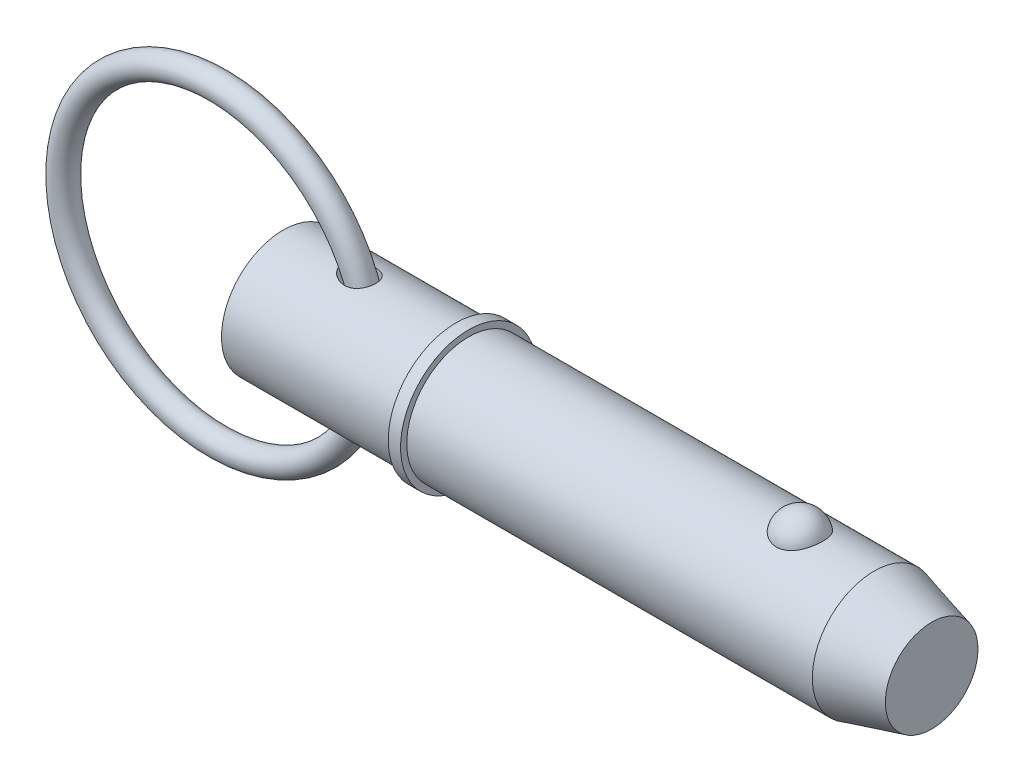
ISO-10303-21;
HEADER;
FILE_DESCRIPTION(('STEP AP214'),'2;1');
FILE_NAME('part.step','',(''),(''),'','','');
FILE_SCHEMA(('AUTOMOTIVE_DESIGN { 1 0 10303 214 1 1 1 1 }'));
ENDSEC;
DATA;
#1=APPLICATION_CONTEXT('core data for automotive mechanical design processes');
#2=APPLICATION_PROTOCOL_DEFINITION('international standard','automotive_design',2000,#1);
#3=PRODUCT_CONTEXT('',#1,'mechanical');
#4=PRODUCT('Part','Part','',(#3));
#5=PRODUCT_RELATED_PRODUCT_CATEGORY('part','',(#4));
#6=PRODUCT_DEFINITION_FORMATION('','',#4);
#7=PRODUCT_DEFINITION_CONTEXT('part definition',#1,'design');
#8=PRODUCT_DEFINITION('design','',#6,#7);
#9=PRODUCT_DEFINITION_SHAPE('','',#8);
#10=(LENGTH_UNIT() NAMED_UNIT(*) SI_UNIT(.MILLI.,.METRE.));
#11=(NAMED_UNIT(*) PLANE_ANGLE_UNIT() SI_UNIT($,.RADIAN.));
#12=(NAMED_UNIT(*) SI_UNIT($,.STERADIAN.) SOLID_ANGLE_UNIT());
#13=UNCERTAINTY_MEASURE_WITH_UNIT(LENGTH_MEASURE(1.E-05),#10,'distance_accuracy_value','');
#14=(GEOMETRIC_REPRESENTATION_CONTEXT(3) GLOBAL_UNCERTAINTY_ASSIGNED_CONTEXT((#13)) GLOBAL_UNIT_ASSIGNED_CONTEXT((#10,
#11,#12)) REPRESENTATION_CONTEXT('',''));
#15=CARTESIAN_POINT('',(0.,0.,0.));
#16=DIRECTION('',(0.,0.,1.));
#17=DIRECTION('',(1.,0.,0.));
#18=AXIS2_PLACEMENT_3D('',#15,#16,#17);
#19=CARTESIAN_POINT('',(-13.4840686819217,0.,0.));
#20=DIRECTION('',(0.,0.,1.));
#21=DIRECTION('',(1.,0.,0.));
#22=AXIS2_PLACEMENT_3D('',#19,#20,#21);
#23=TOROIDAL_SURFACE('',#22,31.75,2.54);
#24=CARTESIAN_POINT('',(20.8059313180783,0.,0.));
#25=VERTEX_POINT('',#24);
#26=VERTEX_LOOP('',#25);
#27=FACE_BOUND('',#26,.T.);
#28=ADVANCED_FACE('P0_F12',(#27),#23,.T.);
#29=CLOSED_SHELL('',(#28));
#30=MANIFOLD_SOLID_BREP('P0_B1',#29);
#31=CARTESIAN_POINT('',(0.,0.,0.));
#32=DIRECTION('',(1.,0.,0.));
#33=DIRECTION('',(0.,0.,-1.));
#34=AXIS2_PLACEMENT_3D('',#31,#32,#33);
#35=CYLINDRICAL_SURFACE('',#34,12.7);
#36=CARTESIAN_POINT('',(13.092900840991,12.5230976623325,-2.11234992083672));
#37=CARTESIAN_POINT('',(13.2535855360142,12.4976398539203,-2.26328363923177));
#38=CARTESIAN_POINT('',(13.4280602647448,12.4718592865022,-2.39955782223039));
#39=CARTESIAN_POINT('',(13.7976341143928,12.4229301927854,-2.64122157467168));
#40=CARTESIAN_POINT('',(13.9927568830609,12.3997847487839,-2.7465751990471));
#41=CARTESIAN_POINT('',(14.397672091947,12.3590534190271,-2.92439761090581));
#42=CARTESIAN_POINT('',(14.6074445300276,12.3414601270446,-2.99691026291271));
#43=CARTESIAN_POINT('',(15.0366557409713,12.3142893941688,-3.10669649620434));
#44=CARTESIAN_POINT('',(15.2560902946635,12.3047084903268,-3.14398530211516));
#45=CARTESIAN_POINT('',(15.5877843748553,12.2976819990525,-3.17128282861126));
#46=CARTESIAN_POINT('',(15.6989364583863,12.2965677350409,-3.17559470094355));
#47=CARTESIAN_POINT('',(15.9211629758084,12.2969101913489,-3.17427486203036));
#48=CARTESIAN_POINT('',(16.0322374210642,12.2983656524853,-3.16864802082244));
#49=CARTESIAN_POINT('',(16.2532861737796,12.3038832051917,-3.14715368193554));
#50=CARTESIAN_POINT('',(16.363260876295,12.3079443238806,-3.13129000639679));
#51=CARTESIAN_POINT('',(16.5810669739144,12.3185954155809,-3.08912320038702));
#52=CARTESIAN_POINT('',(16.6888986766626,12.3251850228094,-3.06282157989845));
#53=CARTESIAN_POINT('',(16.8894247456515,12.3398294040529,-3.00323791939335));
#54=CARTESIAN_POINT('',(16.9824664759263,12.3476389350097,-2.97106098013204));
#55=CARTESIAN_POINT('',(17.1651267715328,12.3648759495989,-2.89848824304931));
#56=CARTESIAN_POINT('',(17.2547457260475,12.3743032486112,-2.85809338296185));
#57=CARTESIAN_POINT('',(17.4297224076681,12.3944822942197,-2.76927391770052));
#58=CARTESIAN_POINT('',(17.5150817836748,12.40523352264,-2.72085245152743));
#59=CARTESIAN_POINT('',(17.6807665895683,12.4277046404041,-2.61629867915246));
#60=CARTESIAN_POINT('',(17.7610923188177,12.4394244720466,-2.56016683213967));
#61=CARTESIAN_POINT('',(17.9797287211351,12.4733252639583,-2.39133767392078));
#62=CARTESIAN_POINT('',(18.1114611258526,12.4961902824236,-2.27005507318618));
#63=CARTESIAN_POINT('',(18.3518677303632,12.5412050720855,-2.00648954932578));
#64=CARTESIAN_POINT('',(18.4605454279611,12.5633549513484,-1.86420981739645));
#65=CARTESIAN_POINT('',(18.6498843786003,12.6039384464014,-1.5661481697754));
#66=CARTESIAN_POINT('',(18.7311185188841,12.622444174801,-1.41073996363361));
#67=CARTESIAN_POINT('',(18.8669149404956,12.6543302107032,-1.08819514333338));
#68=CARTESIAN_POINT('',(18.921477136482,12.6677105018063,-0.921058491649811));
#69=CARTESIAN_POINT('',(19.0028875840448,12.6879542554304,-0.57902988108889));
#70=CARTESIAN_POINT('',(19.0296164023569,12.6947896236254,-0.40410783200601));
#71=CARTESIAN_POINT('',(19.0543673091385,12.7011128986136,-0.0521104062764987));
#72=CARTESIAN_POINT('',(19.0523885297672,12.7006005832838,0.124965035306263));
#73=CARTESIAN_POINT('',(19.019700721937,12.692266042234,0.476969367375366));
#74=CARTESIAN_POINT('',(18.9888798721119,12.6844153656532,0.651887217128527));
#75=CARTESIAN_POINT('',(18.8990221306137,12.6622099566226,0.99389064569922));
#76=CARTESIAN_POINT('',(18.839985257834,12.6478552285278,1.16097622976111));
#77=CARTESIAN_POINT('',(18.6951419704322,12.6142309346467,1.48231767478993));
#78=CARTESIAN_POINT('',(18.6093706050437,12.5949678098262,1.63659000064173));
#79=CARTESIAN_POINT('',(18.4131352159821,12.5536490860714,1.92810749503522));
#80=CARTESIAN_POINT('',(18.3026732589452,12.5315937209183,2.06535408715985));
#81=CARTESIAN_POINT('',(18.060669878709,12.4872833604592,2.31822774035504));
#82=CARTESIAN_POINT('',(17.9292520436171,12.4650302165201,2.43397343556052));
#83=CARTESIAN_POINT('',(17.6485957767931,12.4226514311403,2.64178289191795));
#84=CARTESIAN_POINT('',(17.4993587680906,12.4025256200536,2.73384854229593));
#85=CARTESIAN_POINT('',(17.1869531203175,12.3664726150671,2.8925825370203));
#86=CARTESIAN_POINT('',(17.0237450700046,12.3505578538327,2.95917592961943));
#87=CARTESIAN_POINT('',(16.6884731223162,12.3245177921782,3.06582547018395));
#88=CARTESIAN_POINT('',(16.516407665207,12.3143935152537,3.10587692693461));
#89=CARTESIAN_POINT('',(16.1604213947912,12.3003788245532,3.16093927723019));
#90=CARTESIAN_POINT('',(15.9763106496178,12.2967791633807,3.17478342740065));
#91=CARTESIAN_POINT('',(15.6080973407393,12.2966663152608,3.1752118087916));
#92=CARTESIAN_POINT('',(15.4239948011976,12.3001555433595,3.16178674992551));
#93=CARTESIAN_POINT('',(15.0417156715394,12.3141744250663,3.10676725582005));
#94=CARTESIAN_POINT('',(14.8439465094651,12.3253658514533,3.06251977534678));
#95=CARTESIAN_POINT('',(14.4574652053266,12.3538942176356,2.94531863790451));
#96=CARTESIAN_POINT('',(14.2687614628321,12.3712367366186,2.87233891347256));
#97=CARTESIAN_POINT('',(13.8856104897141,12.4121323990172,2.69045747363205));
#98=CARTESIAN_POINT('',(13.6926012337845,12.4361434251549,2.57861276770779));
#99=CARTESIAN_POINT('',(13.328588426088,12.4862632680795,2.32379935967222));
#100=CARTESIAN_POINT('',(13.1575718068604,12.5123708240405,2.18084927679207));
#101=CARTESIAN_POINT('',(12.8776146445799,12.5579467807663,1.89840233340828));
#102=CARTESIAN_POINT('',(12.7631663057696,12.5776642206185,1.76440341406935));
#103=CARTESIAN_POINT('',(12.5574911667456,12.6143643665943,1.47931295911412));
#104=CARTESIAN_POINT('',(12.4662309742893,12.6313509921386,1.32824646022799));
#105=CARTESIAN_POINT('',(12.3240650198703,12.6583901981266,1.03598403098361));
#106=CARTESIAN_POINT('',(12.2691183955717,12.6691064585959,0.89682285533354));
#107=CARTESIAN_POINT('',(12.1828741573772,12.6860954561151,0.611068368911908));
#108=CARTESIAN_POINT('',(12.1515620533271,12.6923709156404,0.464479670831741));
#109=CARTESIAN_POINT('',(12.1147168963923,12.6997676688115,0.167420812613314));
#110=CARTESIAN_POINT('',(12.109270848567,12.7008715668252,0.0169392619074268));
#111=CARTESIAN_POINT('',(12.1248234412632,12.6977391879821,-0.282592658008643));
#112=CARTESIAN_POINT('',(12.1458245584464,12.6935024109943,-0.431642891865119));
#113=CARTESIAN_POINT('',(12.210908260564,12.6805581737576,-0.716008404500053));
#114=CARTESIAN_POINT('',(12.2537133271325,12.6720986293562,-0.851633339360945));
#115=CARTESIAN_POINT('',(12.3591295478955,12.6516826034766,-1.11460776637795));
#116=CARTESIAN_POINT('',(12.4217455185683,12.6397252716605,-1.24195523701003));
#117=CARTESIAN_POINT('',(12.5735635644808,12.61152213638,-1.50300095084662));
#118=CARTESIAN_POINT('',(12.6652159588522,12.5949150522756,-1.63522875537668));
#119=CARTESIAN_POINT('',(12.8664347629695,12.5599626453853,-1.88501670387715));
#120=CARTESIAN_POINT('',(12.9760196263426,12.541615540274,-2.00256151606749));
#121=CARTESIAN_POINT('',(13.092900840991,12.5230976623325,-2.11234992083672));
#122=B_SPLINE_CURVE_WITH_KNOTS('',3,(#36,#37,#38,#39,#40,#41,#42,#43,#44,#45,#46,#47,#48,#49,
#50,#51,#52,#53,#54,#55,#56,#57,#58,#59,#60,#61,#62,#63,#64,#65,#66,#67,#68,#69,#70,#71,#72,#73,
#74,#75,#76,#77,#78,#79,#80,#81,#82,#83,#84,#85,#86,#87,#88,#89,#90,#91,#92,#93,#94,#95,#96,#97,
#98,#99,#100,#101,#102,#103,#104,#105,#106,#107,#108,#109,#110,#111,#112,#113,#114,#115,#116,
#117,#118,#119,#120,#121),.UNSPECIFIED.,.T.,.F.,(4,2,2,2,2,2,2,2,2,2,2,2,2,2,2,2,2,2,2,2,2,2,2,
2,2,2,2,2,2,2,2,2,2,2,2,2,2,2,2,2,2,2,4),(0.,0.665132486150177,1.33103515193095,
1.99604575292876,2.66076878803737,2.99410229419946,3.32727250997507,3.66031840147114,
3.99331613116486,4.28918991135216,4.58502994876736,4.88075456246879,5.17646157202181,
5.71510826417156,6.25367317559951,6.78017774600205,7.30668400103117,7.83544030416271,
8.36421259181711,8.89504347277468,9.42587399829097,9.95601150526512,10.4861046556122,
11.0131799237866,11.54021312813,12.0687854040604,12.597451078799,13.1491450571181,
13.7010270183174,14.3074556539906,14.914435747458,15.5844380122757,16.2540403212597,
16.7839879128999,17.3131679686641,17.7612578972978,18.2090728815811,18.658393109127,
19.1077554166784,19.5333866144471,19.959121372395,20.4424347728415,20.9262486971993),.UNSPECIFIED.);
#123=CARTESIAN_POINT('',(13.092900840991,12.5230976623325,-2.11234992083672));
#124=VERTEX_POINT('',#123);
#125=EDGE_CURVE('P1_E42',#124,#124,#122,.T.);
#126=ORIENTED_EDGE('',*,*,#125,.T.);
#127=EDGE_LOOP('',(#126));
#128=FACE_BOUND('',#127,.T.);
#129=CARTESIAN_POINT('',(0.,0.,0.));
#130=DIRECTION('',(1.,0.,0.));
#131=DIRECTION('',(0.,0.,-1.));
#132=AXIS2_PLACEMENT_3D('',#129,#130,#131);
#133=CIRCLE('',#132,12.7);
#134=CARTESIAN_POINT('',(0.,0.,-12.7));
#135=VERTEX_POINT('',#134);
#136=EDGE_CURVE('P1_E9',#135,#135,#133,.T.);
#137=ORIENTED_EDGE('',*,*,#136,.T.);
#138=EDGE_LOOP('',(#137));
#139=FACE_BOUND('',#138,.T.);
#140=CARTESIAN_POINT('',(35.56,0.,0.));
#141=DIRECTION('',(1.,0.,0.));
#142=DIRECTION('',(0.,0.,-1.));
#143=AXIS2_PLACEMENT_3D('',#140,#141,#142);
#144=CIRCLE('',#143,12.7);
#145=CARTESIAN_POINT('',(35.56,0.,-12.7));
#146=VERTEX_POINT('',#145);
#147=EDGE_CURVE('P1_E25',#146,#146,#144,.T.);
#148=ORIENTED_EDGE('',*,*,#147,.F.);
#149=EDGE_LOOP('',(#148));
#150=FACE_BOUND('',#149,.T.);
#151=CARTESIAN_POINT('',(13.092900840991,-12.5230976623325,-2.11234992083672));
#152=CARTESIAN_POINT('',(12.9659872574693,-12.5432050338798,-1.99314161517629));
#153=CARTESIAN_POINT('',(12.847667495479,-12.5631124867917,-1.86478966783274));
#154=CARTESIAN_POINT('',(12.6324721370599,-12.6007427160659,-1.59069749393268));
#155=CARTESIAN_POINT('',(12.5355833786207,-12.6184668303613,-1.444968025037));
#156=CARTESIAN_POINT('',(12.4099071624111,-12.642034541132,-1.21450950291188));
#157=CARTESIAN_POINT('',(12.3711427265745,-12.6494175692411,-1.13527163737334));
#158=CARTESIAN_POINT('',(12.3010994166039,-12.6628962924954,-0.973464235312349));
#159=CARTESIAN_POINT('',(12.2698164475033,-12.6689926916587,-0.890896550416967));
#160=CARTESIAN_POINT('',(12.2153933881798,-12.6796767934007,-0.72309085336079));
#161=CARTESIAN_POINT('',(12.192246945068,-12.6842656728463,-0.637854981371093));
#162=CARTESIAN_POINT('',(12.154603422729,-12.6917620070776,-0.465421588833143));
#163=CARTESIAN_POINT('',(12.1401047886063,-12.69466976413,-0.378224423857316));
#164=CARTESIAN_POINT('',(12.1214471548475,-12.6984180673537,-0.214417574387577));
#165=CARTESIAN_POINT('',(12.1161713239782,-12.699481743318,-0.13793855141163));
#166=CARTESIAN_POINT('',(12.1124989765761,-12.7002217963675,0.0152189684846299));
#167=CARTESIAN_POINT('',(12.1141046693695,-12.6998977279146,0.0918975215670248));
#168=CARTESIAN_POINT('',(12.1241695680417,-12.6978712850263,0.244746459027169));
#169=CARTESIAN_POINT('',(12.132625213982,-12.6961696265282,0.320917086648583));
#170=CARTESIAN_POINT('',(12.1562110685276,-12.6914452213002,0.472185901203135));
#171=CARTESIAN_POINT('',(12.1713438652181,-12.6884219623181,0.547283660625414));
#172=CARTESIAN_POINT('',(12.223731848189,-12.6780227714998,0.759415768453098));
#173=CARTESIAN_POINT('',(12.268839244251,-12.6691353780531,0.894507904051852));
#174=CARTESIAN_POINT('',(12.3786059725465,-12.6479567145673,1.1560647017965));
#175=CARTESIAN_POINT('',(12.4432700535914,-12.6356646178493,1.28252725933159));
#176=CARTESIAN_POINT('',(12.5971341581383,-12.607236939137,1.5381272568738));
#177=CARTESIAN_POINT('',(12.6882234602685,-12.5908303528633,1.66609325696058));
#178=CARTESIAN_POINT('',(12.887209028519,-12.5564642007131,1.90792082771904));
#179=CARTESIAN_POINT('',(12.995115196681,-12.5385037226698,2.02177401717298));
#180=CARTESIAN_POINT('',(13.2471335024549,-12.4987806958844,2.25547266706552));
#181=CARTESIAN_POINT('',(13.3941979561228,-12.4769622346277,2.3721269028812));
#182=CARTESIAN_POINT('',(13.7036983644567,-12.4349587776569,2.58329351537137));
#183=CARTESIAN_POINT('',(13.8661464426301,-12.4147750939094,2.67778822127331));
#184=CARTESIAN_POINT('',(14.2306024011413,-12.3748157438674,2.85722657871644));
#185=CARTESIAN_POINT('',(14.4347220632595,-12.3556533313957,2.93804226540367));
#186=CARTESIAN_POINT('',(14.8540416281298,-12.3245430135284,3.06594877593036));
#187=CARTESIAN_POINT('',(15.0692453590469,-12.3125976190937,3.11302786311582));
#188=CARTESIAN_POINT('',(15.3981213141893,-12.3014943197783,3.15648626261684));
#189=CARTESIAN_POINT('',(15.5100235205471,-12.298940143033,3.16639841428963));
#190=CARTESIAN_POINT('',(15.7342812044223,-12.2963942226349,3.17627668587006));
#191=CARTESIAN_POINT('',(15.8466364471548,-12.2964012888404,3.17624742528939));
#192=CARTESIAN_POINT('',(16.0707903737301,-12.2990694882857,3.16589868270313));
#193=CARTESIAN_POINT('',(16.1825892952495,-12.3017293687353,3.1555840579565));
#194=CARTESIAN_POINT('',(16.4046123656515,-12.3096862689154,3.12440163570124));
#195=CARTESIAN_POINT('',(16.514836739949,-12.314982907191,3.10353536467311));
#196=CARTESIAN_POINT('',(16.7211934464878,-12.3273933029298,3.05384263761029));
#197=CARTESIAN_POINT('',(16.8175961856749,-12.3342598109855,3.0260738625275));
#198=CARTESIAN_POINT('',(17.0073515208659,-12.3498131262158,2.96195947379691));
#199=CARTESIAN_POINT('',(17.100704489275,-12.3584997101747,2.92561491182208));
#200=CARTESIAN_POINT('',(17.2834584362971,-12.3774243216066,2.84448580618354));
#201=CARTESIAN_POINT('',(17.3728610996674,-12.3876616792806,2.79970490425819));
#202=CARTESIAN_POINT('',(17.5469061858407,-12.409352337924,2.701939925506));
#203=CARTESIAN_POINT('',(17.6315489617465,-12.4208055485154,2.64895645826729));
#204=CARTESIAN_POINT('',(17.7872886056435,-12.4433734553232,2.54070972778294));
#205=CARTESIAN_POINT('',(17.8589017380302,-12.4544123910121,2.4861716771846));
#206=CARTESIAN_POINT('',(17.9970802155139,-12.4768404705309,2.37105291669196));
#207=CARTESIAN_POINT('',(18.063643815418,-12.4882297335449,2.31047013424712));
#208=CARTESIAN_POINT('',(18.1911677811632,-12.5110137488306,2.18372894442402));
#209=CARTESIAN_POINT('',(18.2521311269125,-12.5224084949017,2.11757353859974));
#210=CARTESIAN_POINT('',(18.3680676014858,-12.5448751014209,1.98014449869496));
#211=CARTESIAN_POINT('',(18.4230385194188,-12.5559468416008,1.90886899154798));
#212=CARTESIAN_POINT('',(18.5752306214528,-12.5875288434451,1.6925769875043));
#213=CARTESIAN_POINT('',(18.6637018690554,-12.6071482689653,1.54111740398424));
#214=CARTESIAN_POINT('',(18.8143485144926,-12.6417556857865,1.225260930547));
#215=CARTESIAN_POINT('',(18.876524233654,-12.6567437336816,1.06086419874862));
#216=CARTESIAN_POINT('',(18.9733884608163,-12.6805238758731,0.723195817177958));
#217=CARTESIAN_POINT('',(19.0079967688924,-12.6892978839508,0.549899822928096));
#218=CARTESIAN_POINT('',(19.0486500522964,-12.6996362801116,0.199781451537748));
#219=CARTESIAN_POINT('',(19.054694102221,-12.7012004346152,0.0229589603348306));
#220=CARTESIAN_POINT('',(19.0380549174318,-12.6969431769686,-0.330044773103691));
#221=CARTESIAN_POINT('',(19.0152419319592,-12.6910884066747,-0.506219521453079));
#222=CARTESIAN_POINT('',(18.9411599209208,-12.672565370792,-0.852112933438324));
#223=CARTESIAN_POINT('',(18.8898907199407,-12.659897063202,-1.0218315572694));
#224=CARTESIAN_POINT('',(18.7600888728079,-12.6291327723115,-1.34987035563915));
#225=CARTESIAN_POINT('',(18.6815715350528,-12.6110398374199,-1.50819687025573));
#226=CARTESIAN_POINT('',(18.4991526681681,-12.5714188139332,-1.808997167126));
#227=CARTESIAN_POINT('',(18.3952529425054,-12.5498909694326,-1.95147207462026));
#228=CARTESIAN_POINT('',(18.1653806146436,-12.5059234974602,-2.21580059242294));
#229=CARTESIAN_POINT('',(18.0395297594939,-12.4834893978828,-2.33776101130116));
#230=CARTESIAN_POINT('',(17.7688701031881,-12.4400863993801,-2.55870399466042));
#231=CARTESIAN_POINT('',(17.624063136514,-12.4191173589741,-2.65768878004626));
#232=CARTESIAN_POINT('',(17.3196803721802,-12.380896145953,-2.8304192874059));
#233=CARTESIAN_POINT('',(17.1601036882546,-12.3636441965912,-2.90416349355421));
#234=CARTESIAN_POINT('',(16.8308162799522,-12.3345597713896,-3.02531546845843));
#235=CARTESIAN_POINT('',(16.6611041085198,-12.322728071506,-3.07271946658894));
#236=CARTESIAN_POINT('',(16.3099674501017,-12.3051318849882,-3.14246490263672));
#237=CARTESIAN_POINT('',(16.1283412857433,-12.2996014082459,-3.16384159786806));
#238=CARTESIAN_POINT('',(15.7639014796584,-12.2955807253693,-3.17942379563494));
#239=CARTESIAN_POINT('',(15.5810875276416,-12.2970924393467,-3.17362188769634));
#240=CARTESIAN_POINT('',(15.20154276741,-12.307074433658,-3.13470416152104));
#241=CARTESIAN_POINT('',(15.0050835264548,-12.316173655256,-3.09911848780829));
#242=CARTESIAN_POINT('',(14.6197996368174,-12.3407987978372,-2.99954607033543));
#243=CARTESIAN_POINT('',(14.4309834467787,-12.3563316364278,-2.93552875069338));
#244=CARTESIAN_POINT('',(14.0353751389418,-12.3949378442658,-2.76840280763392));
#245=CARTESIAN_POINT('',(13.8306109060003,-12.4188242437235,-2.66064798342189));
#246=CARTESIAN_POINT('',(13.4432099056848,-12.4696241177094,-2.4113475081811));
#247=CARTESIAN_POINT('',(13.2605568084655,-12.4965353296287,-2.26982702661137));
#248=CARTESIAN_POINT('',(13.092900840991,-12.5230976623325,-2.11234992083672));
#249=B_SPLINE_CURVE_WITH_KNOTS('',3,(#151,#152,#153,#154,#155,#156,#157,#158,#159,#160,#161,
#162,#163,#164,#165,#166,#167,#168,#169,#170,#171,#172,#173,#174,#175,#176,#177,#178,#179,#180,
#181,#182,#183,#184,#185,#186,#187,#188,#189,#190,#191,#192,#193,#194,#195,#196,#197,#198,#199,
#200,#201,#202,#203,#204,#205,#206,#207,#208,#209,#210,#211,#212,#213,#214,#215,#216,#217,#218,
#219,#220,#221,#222,#223,#224,#225,#226,#227,#228,#229,#230,#231,#232,#233,#234,#235,#236,#237,
#238,#239,#240,#241,#242,#243,#244,#245,#246,#247,#248),.UNSPECIFIED.,.T.,.F.,(4,2,2,2,2,2,2,2,
2,2,2,2,2,2,2,2,2,2,2,2,2,2,2,2,2,2,2,2,2,2,2,2,2,2,2,2,2,2,2,2,2,2,2,2,2,2,2,2,4),(0.,
0.525289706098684,1.05025590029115,1.31549608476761,1.58059075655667,1.84547798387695,
2.11031756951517,2.34000998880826,2.56977615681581,2.79942299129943,3.0291589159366,
3.45531787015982,3.8815803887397,4.35362362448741,4.82594586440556,5.39074449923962,
5.95599200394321,6.61421946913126,7.27267581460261,7.60939383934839,7.94595540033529,
8.2823580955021,8.61871213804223,8.91997243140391,9.22119579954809,9.52228943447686,
9.82336070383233,10.0950952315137,10.3669232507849,10.6386057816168,10.9103882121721,
11.4371688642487,11.9639430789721,12.4922442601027,13.0205625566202,13.5512648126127,
14.0819703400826,14.6123781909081,15.1427483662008,15.6702654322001,16.1977314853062,
16.7252292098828,17.2528024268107,17.7993878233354,18.3461222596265,18.9432829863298,
19.5410874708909,20.2355241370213,20.9294447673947),.UNSPECIFIED.);
#250=CARTESIAN_POINT('',(13.092900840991,-12.5230976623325,-2.11234992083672));
#251=VERTEX_POINT('',#250);
#252=EDGE_CURVE('P1_E17',#251,#251,#249,.T.);
#253=ORIENTED_EDGE('',*,*,#252,.T.);
#254=EDGE_LOOP('',(#253));
#255=FACE_BOUND('',#254,.T.);
#256=ADVANCED_FACE('P1_F13',(#128,#139,#150,#255),#35,.T.);
#257=CARTESIAN_POINT('',(0.,0.,0.));
#258=DIRECTION('',(1.,0.,0.));
#259=DIRECTION('',(0.,0.,-1.));
#260=AXIS2_PLACEMENT_3D('',#257,#258,#259);
#261=CYLINDRICAL_SURFACE('',#260,12.7);
#262=CARTESIAN_POINT('',(121.500738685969,0.,0.));
#263=DIRECTION('',(1.,0.,0.));
#264=DIRECTION('',(0.,0.,-1.));
#265=AXIS2_PLACEMENT_3D('',#262,#263,#264);
#266=CIRCLE('',#265,12.7);
#267=CARTESIAN_POINT('',(121.500738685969,0.,-12.7));
#268=VERTEX_POINT('',#267);
#269=EDGE_CURVE('P1_E99',#268,#268,#266,.T.);
#270=ORIENTED_EDGE('',*,*,#269,.F.);
#271=EDGE_LOOP('',(#270));
#272=FACE_BOUND('',#271,.T.);
#273=CARTESIAN_POINT('',(38.1,0.,0.));
#274=DIRECTION('',(1.,0.,0.));
#275=DIRECTION('',(0.,0.,-1.));
#276=AXIS2_PLACEMENT_3D('',#273,#274,#275);
#277=CIRCLE('',#276,12.7);
#278=CARTESIAN_POINT('',(38.1,0.,-12.7));
#279=VERTEX_POINT('',#278);
#280=EDGE_CURVE('P1_E96',#279,#279,#277,.T.);
#281=ORIENTED_EDGE('',*,*,#280,.T.);
#282=EDGE_LOOP('',(#281));
#283=FACE_BOUND('',#282,.T.);
#284=CARTESIAN_POINT('',(106.260042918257,11.7500437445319,4.8193850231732));
#285=CARTESIAN_POINT('',(106.135088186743,11.7500430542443,4.81938571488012));
#286=CARTESIAN_POINT('',(106.010144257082,11.7520975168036,4.81438658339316));
#287=CARTESIAN_POINT('',(105.761142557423,11.760253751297,4.79442904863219));
#288=CARTESIAN_POINT('',(105.637085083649,11.7663568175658,4.77946746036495));
#289=CARTESIAN_POINT('',(105.390901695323,11.7824262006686,4.73971414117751));
#290=CARTESIAN_POINT('',(105.268774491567,11.7923898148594,4.71492928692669));
#291=CARTESIAN_POINT('',(105.027187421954,11.8158938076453,4.65571340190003));
#292=CARTESIAN_POINT('',(104.90772859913,11.8294355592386,4.62127866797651));
#293=CARTESIAN_POINT('',(104.672557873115,11.8596812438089,4.54309502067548));
#294=CARTESIAN_POINT('',(104.556839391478,11.8763792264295,4.49936361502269));
#295=CARTESIAN_POINT('',(104.329653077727,11.9124878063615,4.40287235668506));
#296=CARTESIAN_POINT('',(104.218186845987,11.9318994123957,4.35010914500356));
#297=CARTESIAN_POINT('',(103.891278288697,11.9934256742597,4.17881316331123));
#298=CARTESIAN_POINT('',(103.683127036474,12.038858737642,4.04720756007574));
#299=CARTESIAN_POINT('',(103.285850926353,12.1352173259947,3.74856446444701));
#300=CARTESIAN_POINT('',(103.097443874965,12.1862630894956,3.58061821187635));
#301=CARTESIAN_POINT('',(102.750521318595,12.2875163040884,3.21600758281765));
#302=CARTESIAN_POINT('',(102.592011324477,12.3377235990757,3.0193379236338));
#303=CARTESIAN_POINT('',(102.30168878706,12.4344923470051,2.592916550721));
#304=CARTESIAN_POINT('',(102.171376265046,12.4807925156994,2.36208286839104));
#305=CARTESIAN_POINT('',(101.949407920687,12.5623454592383,1.88070399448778));
#306=CARTESIAN_POINT('',(101.857755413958,12.5975972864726,1.63015711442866));
#307=CARTESIAN_POINT('',(101.714046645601,12.6538414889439,1.11298869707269));
#308=CARTESIAN_POINT('',(101.662499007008,12.6746503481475,0.846205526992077));
#309=CARTESIAN_POINT('',(101.601977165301,12.699153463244,0.307085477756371));
#310=CARTESIAN_POINT('',(101.593001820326,12.7028481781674,0.0347487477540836));
#311=CARTESIAN_POINT('',(101.617731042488,12.6927785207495,-0.506073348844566));
#312=CARTESIAN_POINT('',(101.651189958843,12.6791146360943,-0.774571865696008));
#313=CARTESIAN_POINT('',(101.759687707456,12.635882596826,-1.30170246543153));
#314=CARTESIAN_POINT('',(101.83472729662,12.606314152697,-1.56033436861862));
#315=CARTESIAN_POINT('',(102.02500006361,12.5342328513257,-2.0608389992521));
#316=CARTESIAN_POINT('',(102.140287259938,12.4917026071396,-2.30268867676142));
#317=CARTESIAN_POINT('',(102.408704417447,12.3981123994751,-2.76259600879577));
#318=CARTESIAN_POINT('',(102.561837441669,12.3470517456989,-2.98065173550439));
#319=CARTESIAN_POINT('',(102.903507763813,12.2416045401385,-3.38786328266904));
#320=CARTESIAN_POINT('',(103.092201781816,12.1872040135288,-3.57688418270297));
#321=CARTESIAN_POINT('',(103.500239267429,12.0814086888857,-3.9194107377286));
#322=CARTESIAN_POINT('',(103.719580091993,12.0300136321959,-4.07291945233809));
#323=CARTESIAN_POINT('',(104.178375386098,11.9373542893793,-4.3369128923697));
#324=CARTESIAN_POINT('',(104.417304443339,11.8958982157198,-4.44824125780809));
#325=CARTESIAN_POINT('',(104.91243761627,11.8268116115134,-4.62881985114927));
#326=CARTESIAN_POINT('',(105.168635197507,11.7991758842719,-4.69808589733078));
#327=CARTESIAN_POINT('',(105.677164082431,11.7622209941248,-4.78983181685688));
#328=CARTESIAN_POINT('',(105.929041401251,11.7520502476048,-4.81449025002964));
#329=CARTESIAN_POINT('',(106.433573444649,11.7485796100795,-4.82295735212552));
#330=CARTESIAN_POINT('',(106.686228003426,11.7552763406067,-4.80677420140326));
#331=CARTESIAN_POINT('',(107.176834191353,11.7842584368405,-4.73525430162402));
#332=CARTESIAN_POINT('',(107.414998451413,11.8060486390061,-4.68116061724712));
#333=CARTESIAN_POINT('',(107.878489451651,11.8622750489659,-4.53678133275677));
#334=CARTESIAN_POINT('',(108.103815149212,11.8967122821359,-4.44649279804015));
#335=CARTESIAN_POINT('',(108.540801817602,11.9754603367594,-4.22987613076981));
#336=CARTESIAN_POINT('',(108.752057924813,12.0199699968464,-4.10280539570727));
#337=CARTESIAN_POINT('',(109.150601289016,12.1138028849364,-3.81685409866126));
#338=CARTESIAN_POINT('',(109.337883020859,12.163127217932,-3.65796622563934));
#339=CARTESIAN_POINT('',(109.693350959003,12.2642343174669,-3.30364864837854));
#340=CARTESIAN_POINT('',(109.860111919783,12.3160165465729,-3.10678783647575));
#341=CARTESIAN_POINT('',(110.159579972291,12.4142566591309,-2.68748409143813));
#342=CARTESIAN_POINT('',(110.292280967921,12.4607135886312,-2.46503658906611));
#343=CARTESIAN_POINT('',(110.524691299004,12.5450236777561,-1.99289519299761));
#344=CARTESIAN_POINT('',(110.623215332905,12.5825557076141,-1.7425591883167));
#345=CARTESIAN_POINT('',(110.779227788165,12.6431720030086,-1.22773734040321));
#346=CARTESIAN_POINT('',(110.836715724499,12.6662560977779,-0.963251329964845));
#347=CARTESIAN_POINT('',(110.909544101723,12.6956486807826,-0.427355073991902));
#348=CARTESIAN_POINT('',(110.924837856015,12.7019385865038,-0.155937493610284));
#349=CARTESIAN_POINT('',(110.912779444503,12.6970201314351,0.38592890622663));
#350=CARTESIAN_POINT('',(110.88542805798,12.6858120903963,0.656377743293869));
#351=CARTESIAN_POINT('',(110.813060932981,12.6568455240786,1.05454017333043));
#352=CARTESIAN_POINT('',(110.783796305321,12.6451962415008,1.185778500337));
#353=CARTESIAN_POINT('',(110.715022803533,12.6181819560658,1.4451380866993));
#354=CARTESIAN_POINT('',(110.675517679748,12.6028183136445,1.57326046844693));
#355=CARTESIAN_POINT('',(110.586439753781,12.5687547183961,1.82554978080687));
#356=CARTESIAN_POINT('',(110.536862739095,12.5500533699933,1.94971503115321));
#357=CARTESIAN_POINT('',(110.42792115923,12.5098093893,2.19314370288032));
#358=CARTESIAN_POINT('',(110.368560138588,12.4882677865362,2.31240887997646));
#359=CARTESIAN_POINT('',(110.23997128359,12.4427679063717,2.5459303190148));
#360=CARTESIAN_POINT('',(110.170688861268,12.4187964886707,2.66015396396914));
#361=CARTESIAN_POINT('',(110.022903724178,12.3691892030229,2.882026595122));
#362=CARTESIAN_POINT('',(109.944404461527,12.3435539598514,2.98967802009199));
#363=CARTESIAN_POINT('',(109.778550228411,12.2912955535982,3.1977438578));
#364=CARTESIAN_POINT('',(109.691191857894,12.2646720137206,3.29815546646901));
#365=CARTESIAN_POINT('',(109.508161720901,12.2111945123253,3.49095035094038));
#366=CARTESIAN_POINT('',(109.412493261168,12.1843406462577,3.58333679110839));
#367=CARTESIAN_POINT('',(109.213627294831,12.1312249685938,3.7592287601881));
#368=CARTESIAN_POINT('',(109.110450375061,12.104961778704,3.84275713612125));
#369=CARTESIAN_POINT('',(108.89701336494,12.0537284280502,4.00056406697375));
#370=CARTESIAN_POINT('',(108.786756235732,12.028757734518,4.07484645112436));
#371=CARTESIAN_POINT('',(108.559755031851,11.9808306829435,4.21367959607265));
#372=CARTESIAN_POINT('',(108.443006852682,11.9578756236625,4.27822410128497));
#373=CARTESIAN_POINT('',(108.20394258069,11.9147184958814,4.39698483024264));
#374=CARTESIAN_POINT('',(108.081628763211,11.894515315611,4.45120522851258));
#375=CARTESIAN_POINT('',(107.822952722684,11.8561129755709,4.55255353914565));
#376=CARTESIAN_POINT('',(107.686223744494,11.8381764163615,4.59884858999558));
#377=CARTESIAN_POINT('',(107.408608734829,11.8069093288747,4.67853897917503));
#378=CARTESIAN_POINT('',(107.267724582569,11.7935767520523,4.71194005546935));
#379=CARTESIAN_POINT('',(106.98309446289,11.7720277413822,4.76552188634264));
#380=CARTESIAN_POINT('',(106.839348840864,11.7638106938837,4.78570422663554));
#381=CARTESIAN_POINT('',(106.550411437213,11.7528195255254,4.8126343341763));
#382=CARTESIAN_POINT('',(106.405219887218,11.7500445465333,4.81938421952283));
#383=CARTESIAN_POINT('',(106.260042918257,11.7500437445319,4.8193850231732));
#384=B_SPLINE_CURVE_WITH_KNOTS('',3,(#284,#285,#286,#287,#288,#289,#290,#291,#292,#293,#294,
#295,#296,#297,#298,#299,#300,#301,#302,#303,#304,#305,#306,#307,#308,#309,#310,#311,#312,#313,
#314,#315,#316,#317,#318,#319,#320,#321,#322,#323,#324,#325,#326,#327,#328,#329,#330,#331,#332,
#333,#334,#335,#336,#337,#338,#339,#340,#341,#342,#343,#344,#345,#346,#347,#348,#349,#350,#351,
#352,#353,#354,#355,#356,#357,#358,#359,#360,#361,#362,#363,#364,#365,#366,#367,#368,#369,#370,
#371,#372,#373,#374,#375,#376,#377,#378,#379,#380,#381,#382,#383),.UNSPECIFIED.,.T.,.F.,(4,2,2,
2,2,2,2,2,2,2,2,2,2,2,2,2,2,2,2,2,2,2,2,2,2,2,2,2,2,2,2,2,2,2,2,2,2,2,2,2,2,2,2,2,2,2,2,2,2,4),
(0.,0.374729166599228,0.749578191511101,1.12416526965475,1.49889629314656,1.87292776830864,
2.2470986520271,2.99481328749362,3.76399449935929,4.53331735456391,5.33683915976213,
6.14042986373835,6.95405296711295,7.76765424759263,8.57656703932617,9.38549455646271,
10.1955119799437,11.0055949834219,11.8193353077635,12.6330054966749,13.4294141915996,
14.2255231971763,14.9815786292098,15.7374826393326,16.4696948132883,17.2019663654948,
17.9501979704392,18.6986017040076,19.4844704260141,20.2704797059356,21.0815215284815,
21.8925729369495,22.70452139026,23.5164550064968,23.9209608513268,24.3253187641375,
24.7298461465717,25.1342272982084,25.5409255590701,25.947471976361,26.3541750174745,
26.7607169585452,27.166183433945,27.5714814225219,27.9770386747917,28.3824315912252,
28.8181206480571,29.2536155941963,29.6890582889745,30.1244323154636),.UNSPECIFIED.);
#385=CARTESIAN_POINT('',(106.260042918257,11.7500437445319,4.8193850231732));
#386=VERTEX_POINT('',#385);
#387=EDGE_CURVE('P1_E34',#386,#386,#384,.T.);
#388=ORIENTED_EDGE('',*,*,#387,.T.);
#389=EDGE_LOOP('',(#388));
#390=FACE_BOUND('',#389,.T.);
#391=ADVANCED_FACE('P1_F46',(#272,#283,#390),#261,.T.);
#392=CARTESIAN_POINT('',(0.,0.,0.));
#393=DIRECTION('',(-1.,0.,0.));
#394=DIRECTION('',(0.,0.,1.));
#395=AXIS2_PLACEMENT_3D('',#392,#393,#394);
#396=PLANE('',#395);
#397=ORIENTED_EDGE('',*,*,#136,.F.);
#398=EDGE_LOOP('',(#397));
#399=FACE_BOUND('',#398,.T.);
#400=ADVANCED_FACE('P1_F15',(#399),#396,.T.);
#401=CARTESIAN_POINT('',(35.56,12.7,0.));
#402=DIRECTION('',(-1.,0.,0.));
#403=DIRECTION('',(0.,0.,1.));
#404=AXIS2_PLACEMENT_3D('',#401,#402,#403);
#405=PLANE('',#404);
#406=ORIENTED_EDGE('',*,*,#147,.T.);
#407=EDGE_LOOP('',(#406));
#408=FACE_BOUND('',#407,.T.);
#409=CARTESIAN_POINT('',(35.56,0.,0.));
#410=DIRECTION('',(1.,0.,0.));
#411=DIRECTION('',(0.,0.,-1.));
#412=AXIS2_PLACEMENT_3D('',#409,#410,#411);
#413=CIRCLE('',#412,13.97);
#414=CARTESIAN_POINT('',(35.56,0.,-13.97));
#415=VERTEX_POINT('',#414);
#416=EDGE_CURVE('P1_E30',#415,#415,#413,.T.);
#417=ORIENTED_EDGE('',*,*,#416,.F.);
#418=EDGE_LOOP('',(#417));
#419=FACE_BOUND('',#418,.T.);
#420=ADVANCED_FACE('P1_F81',(#408,#419),#405,.T.);
#421=CARTESIAN_POINT('',(0.,0.,0.));
#422=DIRECTION('',(1.,0.,0.));
#423=DIRECTION('',(0.,0.,-1.));
#424=AXIS2_PLACEMENT_3D('',#421,#422,#423);
#425=CYLINDRICAL_SURFACE('',#424,13.97);
#426=ORIENTED_EDGE('',*,*,#416,.T.);
#427=EDGE_LOOP('',(#426));
#428=FACE_BOUND('',#427,.T.);
#429=CARTESIAN_POINT('',(38.1,0.,0.));
#430=DIRECTION('',(1.,0.,0.));
#431=DIRECTION('',(0.,0.,-1.));
#432=AXIS2_PLACEMENT_3D('',#429,#430,#431);
#433=CIRCLE('',#432,13.97);
#434=CARTESIAN_POINT('',(38.1,0.,-13.97));
#435=VERTEX_POINT('',#434);
#436=EDGE_CURVE('P1_E95',#435,#435,#433,.T.);
#437=ORIENTED_EDGE('',*,*,#436,.F.);
#438=EDGE_LOOP('',(#437));
#439=FACE_BOUND('',#438,.T.);
#440=ADVANCED_FACE('P1_F68',(#428,#439),#425,.T.);
#441=CARTESIAN_POINT('',(38.1,13.97,0.));
#442=DIRECTION('',(1.,0.,0.));
#443=DIRECTION('',(0.,0.,-1.));
#444=AXIS2_PLACEMENT_3D('',#441,#442,#443);
#445=PLANE('',#444);
#446=ORIENTED_EDGE('',*,*,#436,.T.);
#447=EDGE_LOOP('',(#446));
#448=FACE_BOUND('',#447,.T.);
#449=ORIENTED_EDGE('',*,*,#280,.F.);
#450=EDGE_LOOP('',(#449));
#451=FACE_BOUND('',#450,.T.);
#452=ADVANCED_FACE('P1_F62',(#448,#451),#445,.T.);
#453=CARTESIAN_POINT('',(133.35,0.,0.));
#454=DIRECTION('',(-1.,0.,0.));
#455=DIRECTION('',(0.,0.,1.));
#456=AXIS2_PLACEMENT_3D('',#453,#454,#455);
#457=CONICAL_SURFACE('',#456,9.52500000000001,0.26179938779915);
#458=ORIENTED_EDGE('',*,*,#269,.T.);
#459=EDGE_LOOP('',(#458));
#460=FACE_BOUND('',#459,.T.);
#461=CARTESIAN_POINT('',(133.35,0.,0.));
#462=DIRECTION('',(1.,0.,0.));
#463=DIRECTION('',(0.,0.,-1.));
#464=AXIS2_PLACEMENT_3D('',#461,#462,#463);
#465=CIRCLE('',#464,9.52500000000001);
#466=CARTESIAN_POINT('',(133.35,0.,-9.52500000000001));
#467=VERTEX_POINT('',#466);
#468=EDGE_CURVE('P1_E41',#467,#467,#465,.T.);
#469=ORIENTED_EDGE('',*,*,#468,.F.);
#470=EDGE_LOOP('',(#469));
#471=FACE_BOUND('',#470,.T.);
#472=ADVANCED_FACE('P1_F59',(#460,#471),#457,.T.);
#473=CARTESIAN_POINT('',(133.35,9.52500000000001,0.));
#474=DIRECTION('',(1.,0.,0.));
#475=DIRECTION('',(0.,0.,-1.));
#476=AXIS2_PLACEMENT_3D('',#473,#474,#475);
#477=PLANE('',#476);
#478=ORIENTED_EDGE('',*,*,#468,.T.);
#479=EDGE_LOOP('',(#478));
#480=FACE_BOUND('',#479,.T.);
#481=ADVANCED_FACE('P1_F55',(#480),#477,.T.);
#482=CARTESIAN_POINT('',(106.260042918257,11.43,0.));
#483=DIRECTION('',(-1.,0.,0.));
#484=DIRECTION('',(0.,1.,0.));
#485=AXIS2_PLACEMENT_3D('',#482,#483,#484);
#486=SPHERICAL_SURFACE('',#485,4.83000000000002);
#487=ORIENTED_EDGE('',*,*,#387,.F.);
#488=EDGE_LOOP('',(#487));
#489=FACE_BOUND('',#488,.T.);
#490=ADVANCED_FACE('P1_F50',(#489),#486,.T.);
#491=CARTESIAN_POINT('',(-13.4840686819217,0.,0.));
#492=DIRECTION('',(0.,0.,1.));
#493=DIRECTION('',(1.,0.,0.));
#494=AXIS2_PLACEMENT_3D('',#491,#492,#493);
#495=TOROIDAL_SURFACE('',#494,31.75,3.175);
#496=ORIENTED_EDGE('',*,*,#252,.F.);
#497=EDGE_LOOP('',(#496));
#498=FACE_BOUND('',#497,.T.);
#499=ORIENTED_EDGE('',*,*,#125,.F.);
#500=EDGE_LOOP('',(#499));
#501=FACE_BOUND('',#500,.T.);
#502=ADVANCED_FACE('P1_F54',(#498,#501),#495,.F.);
#503=CLOSED_SHELL('',(#256,#391,#400,#420,#440,#452,#472,#481,#490,#502));
#504=MANIFOLD_SOLID_BREP('P1_B1',#503);
#505=ADVANCED_BREP_SHAPE_REPRESENTATION('',(#18,#30,#504),#14);
#506=SHAPE_DEFINITION_REPRESENTATION(#9,#505);
ENDSEC;
END-ISO-10303-21;
